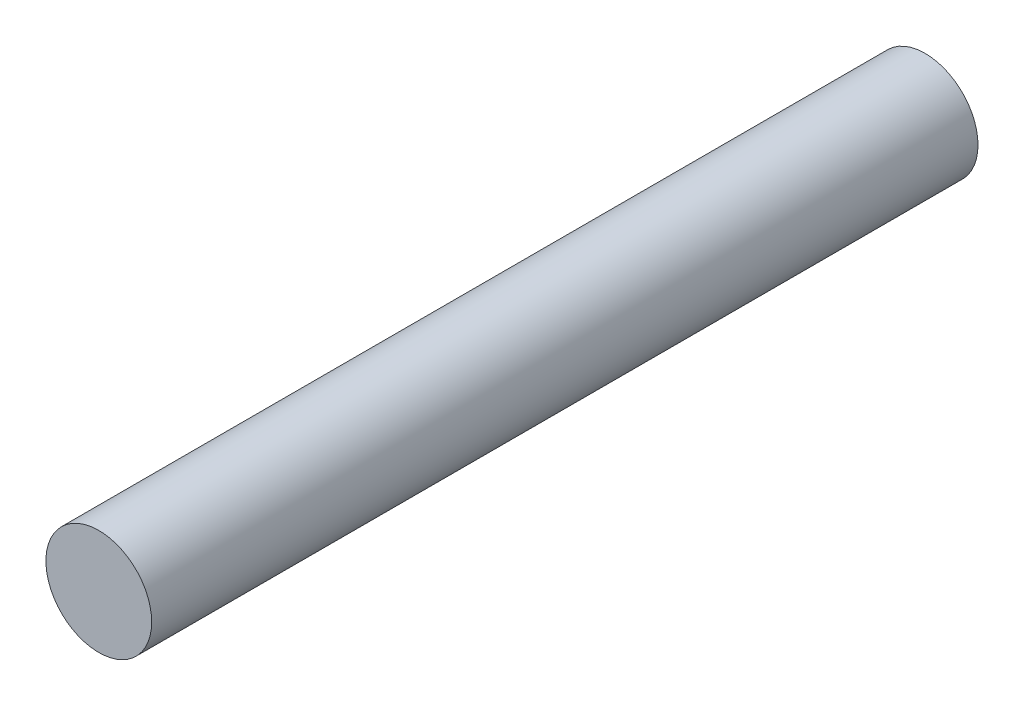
from build123d import *

# Parameters (mm, degrees)
SKETCH1_R           = 1.6
BOSS_EXTRUDE1_DEPTH = 12.5


with BuildPart() as part:
    # Sketch1 → Boss-Extrude1 (new, symmetric)
    with BuildSketch(Plane.XY):
        Circle(SKETCH1_R)
    extrude(amount=BOSS_EXTRUDE1_DEPTH, both=True)


solid = part.part
